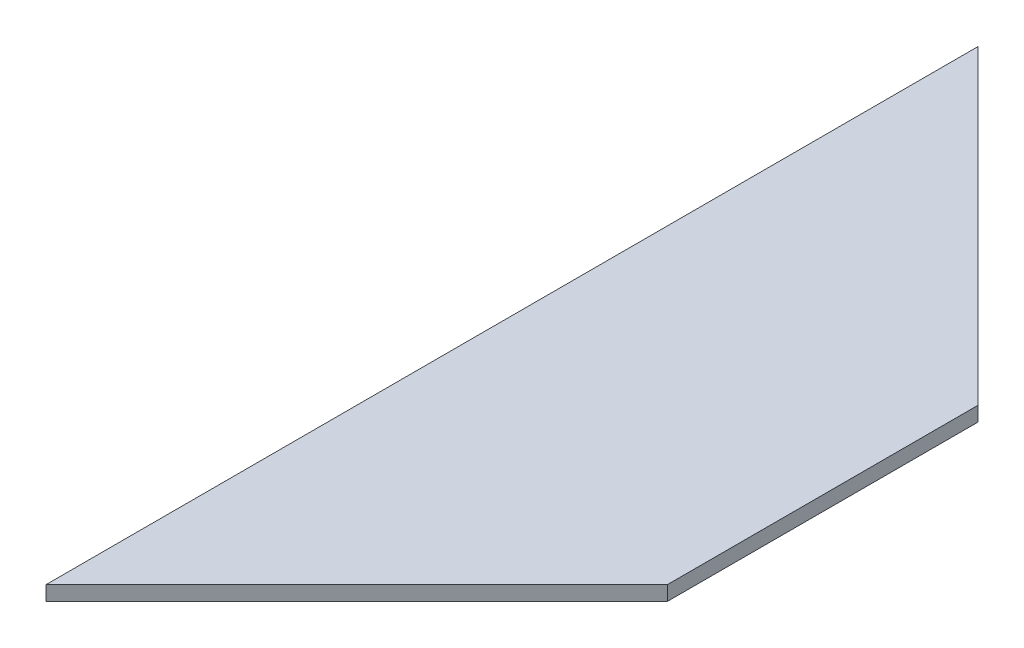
ISO-10303-21;
HEADER;
FILE_DESCRIPTION(('STEP AP214'),'2;1');
FILE_NAME('part.step','',(''),(''),'','','');
FILE_SCHEMA(('AUTOMOTIVE_DESIGN { 1 0 10303 214 1 1 1 1 }'));
ENDSEC;
DATA;
#1=APPLICATION_CONTEXT('core data for automotive mechanical design processes');
#2=APPLICATION_PROTOCOL_DEFINITION('international standard','automotive_design',2000,#1);
#3=PRODUCT_CONTEXT('',#1,'mechanical');
#4=PRODUCT('Part','Part','',(#3));
#5=PRODUCT_RELATED_PRODUCT_CATEGORY('part','',(#4));
#6=PRODUCT_DEFINITION_FORMATION('','',#4);
#7=PRODUCT_DEFINITION_CONTEXT('part definition',#1,'design');
#8=PRODUCT_DEFINITION('design','',#6,#7);
#9=PRODUCT_DEFINITION_SHAPE('','',#8);
#10=(LENGTH_UNIT() NAMED_UNIT(*) SI_UNIT(.MILLI.,.METRE.));
#11=(NAMED_UNIT(*) PLANE_ANGLE_UNIT() SI_UNIT($,.RADIAN.));
#12=(NAMED_UNIT(*) SI_UNIT($,.STERADIAN.) SOLID_ANGLE_UNIT());
#13=UNCERTAINTY_MEASURE_WITH_UNIT(LENGTH_MEASURE(1.E-05),#10,'distance_accuracy_value','');
#14=(GEOMETRIC_REPRESENTATION_CONTEXT(3) GLOBAL_UNCERTAINTY_ASSIGNED_CONTEXT((#13)) GLOBAL_UNIT_ASSIGNED_CONTEXT((#10,
#11,#12)) REPRESENTATION_CONTEXT('',''));
#15=CARTESIAN_POINT('',(0.,0.,0.));
#16=DIRECTION('',(0.,0.,1.));
#17=DIRECTION('',(1.,0.,0.));
#18=AXIS2_PLACEMENT_3D('',#15,#16,#17);
#19=CARTESIAN_POINT('',(-50.8,2.38125,-152.4));
#20=DIRECTION('',(0.,-1.,0.));
#21=DIRECTION('',(0.,0.,-1.));
#22=AXIS2_PLACEMENT_3D('',#19,#20,#21);
#23=PLANE('',#22);
#24=DIRECTION('',(0.,0.,1.));
#25=VECTOR('',#24,1.);
#26=CARTESIAN_POINT('',(-50.8,2.38125,152.4));
#27=LINE('',#26,#25);
#28=CARTESIAN_POINT('',(-50.8,2.38125,152.4));
#29=VERTEX_POINT('',#28);
#30=CARTESIAN_POINT('',(-50.8,2.38125,-152.4));
#31=VERTEX_POINT('',#30);
#32=EDGE_CURVE('E19',#29,#31,#27,.F.);
#33=ORIENTED_EDGE('',*,*,#32,.F.);
#34=DIRECTION('',(0.707106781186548,0.,-0.707106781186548));
#35=VECTOR('',#34,1.);
#36=CARTESIAN_POINT('',(50.8,2.38125,50.8));
#37=LINE('',#36,#35);
#38=CARTESIAN_POINT('',(50.8,2.38125,50.8));
#39=VERTEX_POINT('',#38);
#40=EDGE_CURVE('E78',#39,#29,#37,.F.);
#41=ORIENTED_EDGE('',*,*,#40,.F.);
#42=DIRECTION('',(0.,0.,-1.));
#43=VECTOR('',#42,1.);
#44=CARTESIAN_POINT('',(50.8,2.38125,-50.8));
#45=LINE('',#44,#43);
#46=CARTESIAN_POINT('',(50.8,2.38125,-50.8));
#47=VERTEX_POINT('',#46);
#48=EDGE_CURVE('E54',#47,#39,#45,.F.);
#49=ORIENTED_EDGE('',*,*,#48,.F.);
#50=DIRECTION('',(-0.707106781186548,0.,-0.707106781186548));
#51=VECTOR('',#50,1.);
#52=CARTESIAN_POINT('',(-50.8,2.38125,-152.4));
#53=LINE('',#52,#51);
#54=EDGE_CURVE('E56',#31,#47,#53,.F.);
#55=ORIENTED_EDGE('',*,*,#54,.F.);
#56=EDGE_LOOP('',(#33,#41,#49,#55));
#57=FACE_BOUND('',#56,.T.);
#58=ADVANCED_FACE('F16',(#57),#23,.F.);
#59=CARTESIAN_POINT('',(-50.8,-2.38125,152.4));
#60=DIRECTION('',(-1.,0.,0.));
#61=DIRECTION('',(0.,0.,1.));
#62=AXIS2_PLACEMENT_3D('',#59,#60,#61);
#63=PLANE('',#62);
#64=DIRECTION('',(0.,0.,-1.));
#65=VECTOR('',#64,1.);
#66=CARTESIAN_POINT('',(-50.8,-2.38125,0.));
#67=LINE('',#66,#65);
#68=CARTESIAN_POINT('',(-50.8,-2.38125,152.4));
#69=VERTEX_POINT('',#68);
#70=CARTESIAN_POINT('',(-50.8,-2.38125,-152.4));
#71=VERTEX_POINT('',#70);
#72=EDGE_CURVE('E82',#69,#71,#67,.T.);
#73=ORIENTED_EDGE('',*,*,#72,.F.);
#74=DIRECTION('',(0.,1.,0.));
#75=VECTOR('',#74,1.);
#76=CARTESIAN_POINT('',(-50.8,-2.38125,152.4));
#77=LINE('',#76,#75);
#78=EDGE_CURVE('E67',#29,#69,#77,.F.);
#79=ORIENTED_EDGE('',*,*,#78,.F.);
#80=ORIENTED_EDGE('',*,*,#32,.T.);
#81=DIRECTION('',(0.,1.,0.));
#82=VECTOR('',#81,1.);
#83=CARTESIAN_POINT('',(-50.8,-2.38125,-152.4));
#84=LINE('',#83,#82);
#85=EDGE_CURVE('E62',#71,#31,#84,.T.);
#86=ORIENTED_EDGE('',*,*,#85,.F.);
#87=EDGE_LOOP('',(#73,#79,#80,#86));
#88=FACE_BOUND('',#87,.T.);
#89=ADVANCED_FACE('F64',(#88),#63,.T.);
#90=CARTESIAN_POINT('',(-50.8,-2.38125,-152.4));
#91=DIRECTION('',(0.707106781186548,0.,-0.707106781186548));
#92=DIRECTION('',(-0.707106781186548,0.,-0.707106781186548));
#93=AXIS2_PLACEMENT_3D('',#90,#91,#92);
#94=PLANE('',#93);
#95=DIRECTION('',(0.707106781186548,0.,0.707106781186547));
#96=VECTOR('',#95,1.);
#97=CARTESIAN_POINT('',(-50.8,-2.38125,-152.4));
#98=LINE('',#97,#96);
#99=CARTESIAN_POINT('',(50.8,-2.38125,-50.8));
#100=VERTEX_POINT('',#99);
#101=EDGE_CURVE('E71',#71,#100,#98,.T.);
#102=ORIENTED_EDGE('',*,*,#101,.F.);
#103=ORIENTED_EDGE('',*,*,#85,.T.);
#104=ORIENTED_EDGE('',*,*,#54,.T.);
#105=DIRECTION('',(0.,1.,0.));
#106=VECTOR('',#105,1.);
#107=CARTESIAN_POINT('',(50.8,-2.38125,-50.8));
#108=LINE('',#107,#106);
#109=EDGE_CURVE('E74',#100,#47,#108,.T.);
#110=ORIENTED_EDGE('',*,*,#109,.F.);
#111=EDGE_LOOP('',(#102,#103,#104,#110));
#112=FACE_BOUND('',#111,.T.);
#113=ADVANCED_FACE('F69',(#112),#94,.T.);
#114=CARTESIAN_POINT('',(50.8,-2.38125,-50.8));
#115=DIRECTION('',(1.,0.,0.));
#116=DIRECTION('',(0.,0.,-1.));
#117=AXIS2_PLACEMENT_3D('',#114,#115,#116);
#118=PLANE('',#117);
#119=DIRECTION('',(0.,0.,-1.));
#120=VECTOR('',#119,1.);
#121=CARTESIAN_POINT('',(50.8,-2.38125,0.));
#122=LINE('',#121,#120);
#123=CARTESIAN_POINT('',(50.8,-2.38125,50.8));
#124=VERTEX_POINT('',#123);
#125=EDGE_CURVE('E25',#100,#124,#122,.F.);
#126=ORIENTED_EDGE('',*,*,#125,.F.);
#127=ORIENTED_EDGE('',*,*,#109,.T.);
#128=ORIENTED_EDGE('',*,*,#48,.T.);
#129=DIRECTION('',(0.,1.,0.));
#130=VECTOR('',#129,1.);
#131=CARTESIAN_POINT('',(50.8,-2.38125,50.8));
#132=LINE('',#131,#130);
#133=EDGE_CURVE('E34',#124,#39,#132,.T.);
#134=ORIENTED_EDGE('',*,*,#133,.F.);
#135=EDGE_LOOP('',(#126,#127,#128,#134));
#136=FACE_BOUND('',#135,.T.);
#137=ADVANCED_FACE('F88',(#136),#118,.T.);
#138=CARTESIAN_POINT('',(50.8,-2.38125,50.8));
#139=DIRECTION('',(0.707106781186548,0.,0.707106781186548));
#140=DIRECTION('',(0.707106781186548,0.,-0.707106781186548));
#141=AXIS2_PLACEMENT_3D('',#138,#139,#140);
#142=PLANE('',#141);
#143=DIRECTION('',(-0.707106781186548,0.,0.707106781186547));
#144=VECTOR('',#143,1.);
#145=CARTESIAN_POINT('',(50.8,-2.38125,50.8));
#146=LINE('',#145,#144);
#147=EDGE_CURVE('E11',#124,#69,#146,.T.);
#148=ORIENTED_EDGE('',*,*,#147,.F.);
#149=ORIENTED_EDGE('',*,*,#133,.T.);
#150=ORIENTED_EDGE('',*,*,#40,.T.);
#151=ORIENTED_EDGE('',*,*,#78,.T.);
#152=EDGE_LOOP('',(#148,#149,#150,#151));
#153=FACE_BOUND('',#152,.T.);
#154=ADVANCED_FACE('F90',(#153),#142,.T.);
#155=CARTESIAN_POINT('',(0.,-2.38125,0.));
#156=DIRECTION('',(0.,-1.,0.));
#157=DIRECTION('',(0.,0.,-1.));
#158=AXIS2_PLACEMENT_3D('',#155,#156,#157);
#159=PLANE('',#158);
#160=ORIENTED_EDGE('',*,*,#125,.T.);
#161=ORIENTED_EDGE('',*,*,#147,.T.);
#162=ORIENTED_EDGE('',*,*,#72,.T.);
#163=ORIENTED_EDGE('',*,*,#101,.T.);
#164=EDGE_LOOP('',(#160,#161,#162,#163));
#165=FACE_BOUND('',#164,.T.);
#166=ADVANCED_FACE('F87',(#165),#159,.T.);
#167=CLOSED_SHELL('',(#58,#89,#113,#137,#154,#166));
#168=MANIFOLD_SOLID_BREP('B1',#167);
#169=ADVANCED_BREP_SHAPE_REPRESENTATION('',(#18,#168),#14);
#170=SHAPE_DEFINITION_REPRESENTATION(#9,#169);
ENDSEC;
END-ISO-10303-21;
